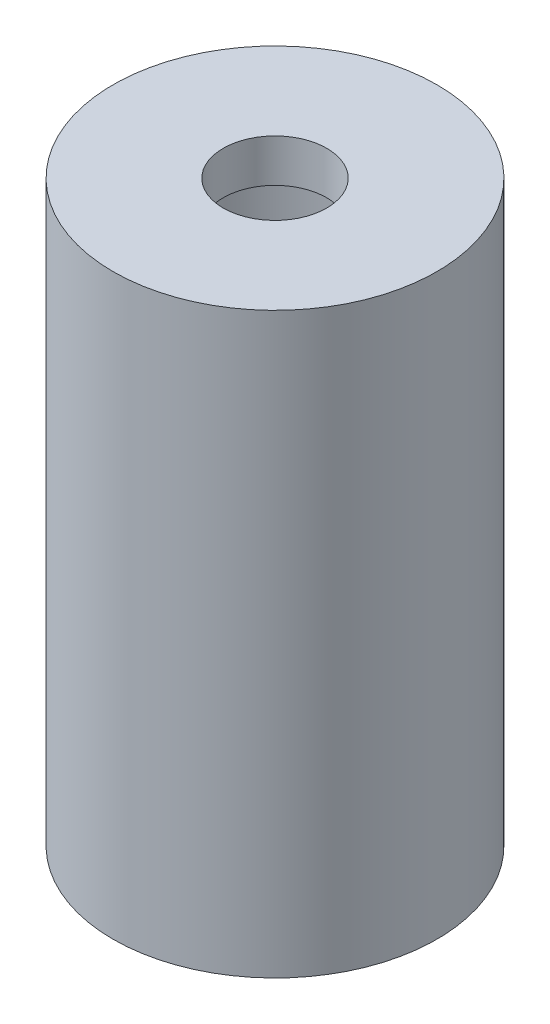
ISO-10303-21;
HEADER;
FILE_DESCRIPTION(('STEP AP214'),'2;1');
FILE_NAME('part.step','',(''),(''),'','','');
FILE_SCHEMA(('AUTOMOTIVE_DESIGN { 1 0 10303 214 1 1 1 1 }'));
ENDSEC;
DATA;
#1=APPLICATION_CONTEXT('core data for automotive mechanical design processes');
#2=APPLICATION_PROTOCOL_DEFINITION('international standard','automotive_design',2000,#1);
#3=PRODUCT_CONTEXT('',#1,'mechanical');
#4=PRODUCT('Part','Part','',(#3));
#5=PRODUCT_RELATED_PRODUCT_CATEGORY('part','',(#4));
#6=PRODUCT_DEFINITION_FORMATION('','',#4);
#7=PRODUCT_DEFINITION_CONTEXT('part definition',#1,'design');
#8=PRODUCT_DEFINITION('design','',#6,#7);
#9=PRODUCT_DEFINITION_SHAPE('','',#8);
#10=(LENGTH_UNIT() NAMED_UNIT(*) SI_UNIT(.MILLI.,.METRE.));
#11=(NAMED_UNIT(*) PLANE_ANGLE_UNIT() SI_UNIT($,.RADIAN.));
#12=(NAMED_UNIT(*) SI_UNIT($,.STERADIAN.) SOLID_ANGLE_UNIT());
#13=UNCERTAINTY_MEASURE_WITH_UNIT(LENGTH_MEASURE(1.E-05),#10,'distance_accuracy_value','');
#14=(GEOMETRIC_REPRESENTATION_CONTEXT(3) GLOBAL_UNCERTAINTY_ASSIGNED_CONTEXT((#13)) GLOBAL_UNIT_ASSIGNED_CONTEXT((#10,
#11,#12)) REPRESENTATION_CONTEXT('',''));
#15=CARTESIAN_POINT('',(0.,0.,0.));
#16=DIRECTION('',(0.,0.,1.));
#17=DIRECTION('',(1.,0.,0.));
#18=AXIS2_PLACEMENT_3D('',#15,#16,#17);
#19=CARTESIAN_POINT('',(0.,0.,0.));
#20=DIRECTION('',(0.,1.,0.));
#21=DIRECTION('',(0.,0.,1.));
#22=AXIS2_PLACEMENT_3D('',#19,#20,#21);
#23=PLANE('',#22);
#24=CARTESIAN_POINT('',(0.,0.,0.));
#25=DIRECTION('',(0.,1.,0.));
#26=DIRECTION('',(0.,0.,1.));
#27=AXIS2_PLACEMENT_3D('',#24,#25,#26);
#28=CIRCLE('',#27,37.8);
#29=CARTESIAN_POINT('',(0.,0.,37.8));
#30=VERTEX_POINT('',#29);
#31=EDGE_CURVE('E10',#30,#30,#28,.T.);
#32=ORIENTED_EDGE('',*,*,#31,.F.);
#33=EDGE_LOOP('',(#32));
#34=FACE_BOUND('',#33,.T.);
#35=CARTESIAN_POINT('',(0.,0.,0.));
#36=DIRECTION('',(0.,1.,0.));
#37=DIRECTION('',(0.,0.,1.));
#38=AXIS2_PLACEMENT_3D('',#35,#36,#37);
#39=CIRCLE('',#38,27.8);
#40=CARTESIAN_POINT('',(0.,0.,27.8));
#41=VERTEX_POINT('',#40);
#42=EDGE_CURVE('E55',#41,#41,#39,.T.);
#43=ORIENTED_EDGE('',*,*,#42,.T.);
#44=EDGE_LOOP('',(#43));
#45=FACE_BOUND('',#44,.T.);
#46=ADVANCED_FACE('F47',(#34,#45),#23,.F.);
#47=CARTESIAN_POINT('',(0.,125.,0.));
#48=DIRECTION('',(0.,-1.,0.));
#49=DIRECTION('',(0.,0.,-1.));
#50=AXIS2_PLACEMENT_3D('',#47,#48,#49);
#51=CYLINDRICAL_SURFACE('',#50,37.8);
#52=ORIENTED_EDGE('',*,*,#31,.T.);
#53=EDGE_LOOP('',(#52));
#54=FACE_BOUND('',#53,.T.);
#55=CARTESIAN_POINT('',(0.,135.,0.));
#56=DIRECTION('',(0.,1.,0.));
#57=DIRECTION('',(0.,0.,1.));
#58=AXIS2_PLACEMENT_3D('',#55,#56,#57);
#59=CIRCLE('',#58,37.8);
#60=CARTESIAN_POINT('',(0.,135.,37.8));
#61=VERTEX_POINT('',#60);
#62=EDGE_CURVE('E69',#61,#61,#59,.T.);
#63=ORIENTED_EDGE('',*,*,#62,.F.);
#64=EDGE_LOOP('',(#63));
#65=FACE_BOUND('',#64,.T.);
#66=ADVANCED_FACE('F49',(#54,#65),#51,.T.);
#67=CARTESIAN_POINT('',(0.,125.,0.));
#68=DIRECTION('',(0.,-1.,0.));
#69=DIRECTION('',(0.,0.,-1.));
#70=AXIS2_PLACEMENT_3D('',#67,#68,#69);
#71=CYLINDRICAL_SURFACE('',#70,27.8);
#72=CARTESIAN_POINT('',(0.,125.,0.));
#73=DIRECTION('',(0.,1.,0.));
#74=DIRECTION('',(0.,0.,1.));
#75=AXIS2_PLACEMENT_3D('',#72,#73,#74);
#76=CIRCLE('',#75,27.8);
#77=CARTESIAN_POINT('',(0.,125.,27.8));
#78=VERTEX_POINT('',#77);
#79=EDGE_CURVE('E63',#78,#78,#76,.T.);
#80=ORIENTED_EDGE('',*,*,#79,.T.);
#81=EDGE_LOOP('',(#80));
#82=FACE_BOUND('',#81,.T.);
#83=ORIENTED_EDGE('',*,*,#42,.F.);
#84=EDGE_LOOP('',(#83));
#85=FACE_BOUND('',#84,.T.);
#86=ADVANCED_FACE('F99',(#82,#85),#71,.F.);
#87=CARTESIAN_POINT('',(0.,125.,0.));
#88=DIRECTION('',(0.,1.,0.));
#89=DIRECTION('',(0.,0.,1.));
#90=AXIS2_PLACEMENT_3D('',#87,#88,#89);
#91=PLANE('',#90);
#92=CARTESIAN_POINT('',(0.,125.,0.));
#93=DIRECTION('',(0.,1.,0.));
#94=DIRECTION('',(0.,0.,1.));
#95=AXIS2_PLACEMENT_3D('',#92,#93,#94);
#96=CIRCLE('',#95,12.0895971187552);
#97=CARTESIAN_POINT('',(0.,125.,12.0895971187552));
#98=VERTEX_POINT('',#97);
#99=EDGE_CURVE('E75',#98,#98,#96,.T.);
#100=ORIENTED_EDGE('',*,*,#99,.T.);
#101=EDGE_LOOP('',(#100));
#102=FACE_BOUND('',#101,.T.);
#103=ORIENTED_EDGE('',*,*,#79,.F.);
#104=EDGE_LOOP('',(#103));
#105=FACE_BOUND('',#104,.T.);
#106=ADVANCED_FACE('F83',(#102,#105),#91,.F.);
#107=CARTESIAN_POINT('',(0.,135.,0.));
#108=DIRECTION('',(0.,1.,0.));
#109=DIRECTION('',(0.,0.,1.));
#110=AXIS2_PLACEMENT_3D('',#107,#108,#109);
#111=PLANE('',#110);
#112=CARTESIAN_POINT('',(0.,135.,0.));
#113=DIRECTION('',(0.,1.,0.));
#114=DIRECTION('',(0.,0.,1.));
#115=AXIS2_PLACEMENT_3D('',#112,#113,#114);
#116=CIRCLE('',#115,12.0895971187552);
#117=CARTESIAN_POINT('',(0.,135.,12.0895971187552));
#118=VERTEX_POINT('',#117);
#119=EDGE_CURVE('E76',#118,#118,#116,.T.);
#120=ORIENTED_EDGE('',*,*,#119,.F.);
#121=EDGE_LOOP('',(#120));
#122=FACE_BOUND('',#121,.T.);
#123=ORIENTED_EDGE('',*,*,#62,.T.);
#124=EDGE_LOOP('',(#123));
#125=FACE_BOUND('',#124,.T.);
#126=ADVANCED_FACE('F89',(#122,#125),#111,.T.);
#127=CARTESIAN_POINT('',(0.,125.,0.));
#128=DIRECTION('',(0.,1.,0.));
#129=DIRECTION('',(0.,0.,1.));
#130=AXIS2_PLACEMENT_3D('',#127,#128,#129);
#131=CYLINDRICAL_SURFACE('',#130,12.0895971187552);
#132=ORIENTED_EDGE('',*,*,#99,.F.);
#133=EDGE_LOOP('',(#132));
#134=FACE_BOUND('',#133,.T.);
#135=ORIENTED_EDGE('',*,*,#119,.T.);
#136=EDGE_LOOP('',(#135));
#137=FACE_BOUND('',#136,.T.);
#138=ADVANCED_FACE('F86',(#134,#137),#131,.F.);
#139=CLOSED_SHELL('',(#46,#66,#86,#106,#126,#138));
#140=MANIFOLD_SOLID_BREP('B2',#139);
#141=ADVANCED_BREP_SHAPE_REPRESENTATION('',(#18,#140),#14);
#142=SHAPE_DEFINITION_REPRESENTATION(#9,#141);
ENDSEC;
END-ISO-10303-21;
